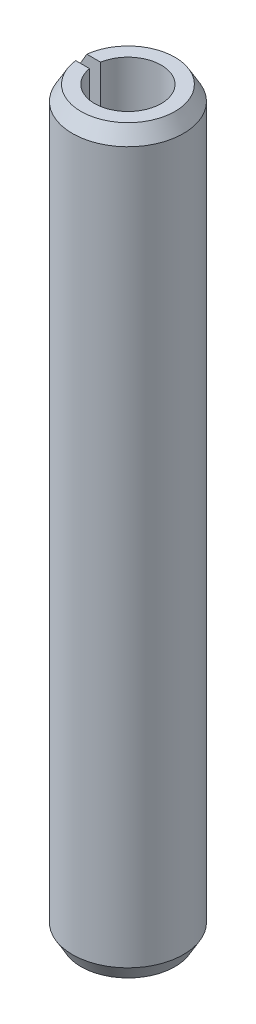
ISO-10303-21;
HEADER;
FILE_DESCRIPTION(('STEP AP214'),'2;1');
FILE_NAME('part.step','',(''),(''),'','','');
FILE_SCHEMA(('AUTOMOTIVE_DESIGN { 1 0 10303 214 1 1 1 1 }'));
ENDSEC;
DATA;
#1=APPLICATION_CONTEXT('core data for automotive mechanical design processes');
#2=APPLICATION_PROTOCOL_DEFINITION('international standard','automotive_design',2000,#1);
#3=PRODUCT_CONTEXT('',#1,'mechanical');
#4=PRODUCT('Part','Part','',(#3));
#5=PRODUCT_RELATED_PRODUCT_CATEGORY('part','',(#4));
#6=PRODUCT_DEFINITION_FORMATION('','',#4);
#7=PRODUCT_DEFINITION_CONTEXT('part definition',#1,'design');
#8=PRODUCT_DEFINITION('design','',#6,#7);
#9=PRODUCT_DEFINITION_SHAPE('','',#8);
#10=(LENGTH_UNIT() NAMED_UNIT(*) SI_UNIT(.MILLI.,.METRE.));
#11=(NAMED_UNIT(*) PLANE_ANGLE_UNIT() SI_UNIT($,.RADIAN.));
#12=(NAMED_UNIT(*) SI_UNIT($,.STERADIAN.) SOLID_ANGLE_UNIT());
#13=UNCERTAINTY_MEASURE_WITH_UNIT(LENGTH_MEASURE(1.E-05),#10,'distance_accuracy_value','');
#14=(GEOMETRIC_REPRESENTATION_CONTEXT(3) GLOBAL_UNCERTAINTY_ASSIGNED_CONTEXT((#13)) GLOBAL_UNIT_ASSIGNED_CONTEXT((#10,
#11,#12)) REPRESENTATION_CONTEXT('',''));
#15=CARTESIAN_POINT('',(0.,0.,0.));
#16=DIRECTION('',(0.,0.,1.));
#17=DIRECTION('',(1.,0.,0.));
#18=AXIS2_PLACEMENT_3D('',#15,#16,#17);
#19=CARTESIAN_POINT('',(0.,0.,0.));
#20=DIRECTION('',(0.,-1.,0.));
#21=DIRECTION('',(0.,0.,-0.999999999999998));
#22=AXIS2_PLACEMENT_3D('',#19,#20,#21);
#23=CYLINDRICAL_SURFACE('',#22,0.9);
#24=DIRECTION('',(0.,-1.,0.));
#25=VECTOR('',#24,1.);
#26=CARTESIAN_POINT('',(-0.887411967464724,0.,-0.150000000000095));
#27=LINE('',#26,#25);
#28=CARTESIAN_POINT('',(-0.887411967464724,0.,-0.150000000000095));
#29=VERTEX_POINT('',#28);
#30=CARTESIAN_POINT('',(-0.887411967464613,20.,-0.150000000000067));
#31=VERTEX_POINT('',#30);
#32=EDGE_CURVE('E88',#29,#31,#27,.F.);
#33=ORIENTED_EDGE('',*,*,#32,.F.);
#34=CARTESIAN_POINT('',(0.,0.,0.));
#35=DIRECTION('',(0.,-1.,0.));
#36=DIRECTION('',(0.,0.,-0.999999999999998));
#37=AXIS2_PLACEMENT_3D('',#34,#35,#36);
#38=CIRCLE('',#37,0.9);
#39=CARTESIAN_POINT('',(-0.887411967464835,0.,0.1499999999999));
#40=VERTEX_POINT('',#39);
#41=EDGE_CURVE('E100',#29,#40,#38,.T.);
#42=ORIENTED_EDGE('',*,*,#41,.T.);
#43=DIRECTION('',(0.,-1.,0.));
#44=VECTOR('',#43,1.);
#45=CARTESIAN_POINT('',(-0.887411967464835,0.,0.1499999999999));
#46=LINE('',#45,#44);
#47=CARTESIAN_POINT('',(-0.887411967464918,20.,0.149999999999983));
#48=VERTEX_POINT('',#47);
#49=EDGE_CURVE('E139',#48,#40,#46,.T.);
#50=ORIENTED_EDGE('',*,*,#49,.F.);
#51=CARTESIAN_POINT('',(0.,20.0000000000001,0.));
#52=DIRECTION('',(0.,-1.,0.));
#53=DIRECTION('',(0.,0.,-0.999999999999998));
#54=AXIS2_PLACEMENT_3D('',#51,#52,#53);
#55=CIRCLE('',#54,0.9);
#56=EDGE_CURVE('E102',#31,#48,#55,.T.);
#57=ORIENTED_EDGE('',*,*,#56,.F.);
#58=EDGE_LOOP('',(#33,#42,#50,#57));
#59=FACE_BOUND('',#58,.T.);
#60=ADVANCED_FACE('F31',(#59),#23,.F.);
#61=CARTESIAN_POINT('',(0.900000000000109,20.,-1.11022302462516E-13));
#62=DIRECTION('',(0.,1.,0.));
#63=DIRECTION('',(0.,0.,0.999999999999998));
#64=AXIS2_PLACEMENT_3D('',#61,#62,#63);
#65=PLANE('',#64);
#66=DIRECTION('',(-0.999999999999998,0.,0.));
#67=VECTOR('',#66,1.);
#68=CARTESIAN_POINT('',(0.,20.,-0.150000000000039));
#69=LINE('',#68,#67);
#70=CARTESIAN_POINT('',(-1.26016388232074,20.,-0.150000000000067));
#71=VERTEX_POINT('',#70);
#72=EDGE_CURVE('E157',#31,#71,#69,.T.);
#73=ORIENTED_EDGE('',*,*,#72,.F.);
#74=ORIENTED_EDGE('',*,*,#56,.T.);
#75=DIRECTION('',(0.999999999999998,0.,0.));
#76=VECTOR('',#75,1.);
#77=CARTESIAN_POINT('',(2.22044604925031E-13,19.9999999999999,0.149999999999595));
#78=LINE('',#77,#76);
#79=CARTESIAN_POINT('',(-1.26016388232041,20.,0.149999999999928));
#80=VERTEX_POINT('',#79);
#81=EDGE_CURVE('E94',#80,#48,#78,.T.);
#82=ORIENTED_EDGE('',*,*,#81,.F.);
#83=CARTESIAN_POINT('',(0.,20.0000000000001,0.));
#84=DIRECTION('',(0.,1.,0.));
#85=DIRECTION('',(0.,0.,0.999999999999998));
#86=AXIS2_PLACEMENT_3D('',#83,#84,#85);
#87=CIRCLE('',#86,1.26905989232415);
#88=EDGE_CURVE('E116',#80,#71,#87,.T.);
#89=ORIENTED_EDGE('',*,*,#88,.T.);
#90=EDGE_LOOP('',(#73,#74,#82,#89));
#91=FACE_BOUND('',#90,.T.);
#92=ADVANCED_FACE('F155',(#91),#65,.T.);
#93=CARTESIAN_POINT('',(0.,0.,0.));
#94=DIRECTION('',(0.,-1.,0.));
#95=DIRECTION('',(0.,0.,-0.999999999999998));
#96=AXIS2_PLACEMENT_3D('',#93,#94,#95);
#97=CYLINDRICAL_SURFACE('',#96,1.5);
#98=DIRECTION('',(0.,-1.,0.));
#99=VECTOR('',#98,1.);
#100=CARTESIAN_POINT('',(-1.49248115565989,0.,-0.150000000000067));
#101=LINE('',#100,#99);
#102=CARTESIAN_POINT('',(-1.49248115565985,19.6,-0.150000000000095));
#103=VERTEX_POINT('',#102);
#104=CARTESIAN_POINT('',(-1.49248115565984,0.400000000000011,-0.150000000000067));
#105=VERTEX_POINT('',#104);
#106=EDGE_CURVE('E57',#103,#105,#101,.T.);
#107=ORIENTED_EDGE('',*,*,#106,.F.);
#108=CARTESIAN_POINT('',(0.,19.6,0.));
#109=DIRECTION('',(0.,1.,0.));
#110=DIRECTION('',(0.,0.,0.999999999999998));
#111=AXIS2_PLACEMENT_3D('',#108,#109,#110);
#112=CIRCLE('',#111,1.5);
#113=CARTESIAN_POINT('',(-1.49248115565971,19.6,0.150000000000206));
#114=VERTEX_POINT('',#113);
#115=EDGE_CURVE('E113',#103,#114,#112,.F.);
#116=ORIENTED_EDGE('',*,*,#115,.T.);
#117=DIRECTION('',(0.,-1.,0.));
#118=VECTOR('',#117,1.);
#119=CARTESIAN_POINT('',(-1.49248115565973,0.,0.149999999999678));
#120=LINE('',#119,#118);
#121=CARTESIAN_POINT('',(-1.49248115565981,0.400000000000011,0.150000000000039));
#122=VERTEX_POINT('',#121);
#123=EDGE_CURVE('E140',#122,#114,#120,.F.);
#124=ORIENTED_EDGE('',*,*,#123,.F.);
#125=CARTESIAN_POINT('',(2.77555756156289E-13,0.3999999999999,-1.11022302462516E-13));
#126=DIRECTION('',(0.,-1.,0.));
#127=DIRECTION('',(0.,0.,-0.999999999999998));
#128=AXIS2_PLACEMENT_3D('',#125,#126,#127);
#129=CIRCLE('',#128,1.5);
#130=EDGE_CURVE('E107',#122,#105,#129,.F.);
#131=ORIENTED_EDGE('',*,*,#130,.T.);
#132=EDGE_LOOP('',(#107,#116,#124,#131));
#133=FACE_BOUND('',#132,.T.);
#134=ADVANCED_FACE('F166',(#133),#97,.T.);
#135=CARTESIAN_POINT('',(0.900000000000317,0.,0.));
#136=DIRECTION('',(0.,-1.,0.));
#137=DIRECTION('',(0.,0.,-0.999999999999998));
#138=AXIS2_PLACEMENT_3D('',#135,#136,#137);
#139=PLANE('',#138);
#140=DIRECTION('',(-0.999999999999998,0.,0.));
#141=VECTOR('',#140,1.);
#142=CARTESIAN_POINT('',(2.4980018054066E-13,0.,-0.1499999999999));
#143=LINE('',#142,#141);
#144=CARTESIAN_POINT('',(-1.26016388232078,0.,-0.150000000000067));
#145=VERTEX_POINT('',#144);
#146=EDGE_CURVE('E85',#29,#145,#143,.T.);
#147=ORIENTED_EDGE('',*,*,#146,.T.);
#148=CARTESIAN_POINT('',(0.,0.,0.));
#149=DIRECTION('',(0.,-1.,0.));
#150=DIRECTION('',(0.,0.,-0.999999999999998));
#151=AXIS2_PLACEMENT_3D('',#148,#149,#150);
#152=CIRCLE('',#151,1.26905989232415);
#153=CARTESIAN_POINT('',(-1.26016388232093,0.,0.149999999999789));
#154=VERTEX_POINT('',#153);
#155=EDGE_CURVE('E119',#145,#154,#152,.T.);
#156=ORIENTED_EDGE('',*,*,#155,.T.);
#157=DIRECTION('',(0.999999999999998,0.,0.));
#158=VECTOR('',#157,1.);
#159=CARTESIAN_POINT('',(0.,0.,0.149999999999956));
#160=LINE('',#159,#158);
#161=EDGE_CURVE('E50',#154,#40,#160,.T.);
#162=ORIENTED_EDGE('',*,*,#161,.T.);
#163=ORIENTED_EDGE('',*,*,#41,.F.);
#164=EDGE_LOOP('',(#147,#156,#162,#163));
#165=FACE_BOUND('',#164,.T.);
#166=ADVANCED_FACE('F105',(#165),#139,.T.);
#167=CARTESIAN_POINT('',(0.,19.6,0.));
#168=DIRECTION('',(0.,-1.,0.));
#169=DIRECTION('',(0.,0.,-0.999999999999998));
#170=AXIS2_PLACEMENT_3D('',#167,#168,#169);
#171=CONICAL_SURFACE('',#170,1.5,0.523598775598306);
#172=CARTESIAN_POINT('',(-0.435283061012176,21.4006340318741,-0.150000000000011));
#173=CARTESIAN_POINT('',(-0.461935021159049,21.3569640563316,-0.149999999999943));
#174=CARTESIAN_POINT('',(-0.488422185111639,21.3131943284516,-0.14999999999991));
#175=CARTESIAN_POINT('',(-0.541157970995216,21.2255120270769,-0.149999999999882));
#176=CARTESIAN_POINT('',(-0.567406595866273,21.1815994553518,-0.149999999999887));
#177=CARTESIAN_POINT('',(-0.645931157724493,21.0497326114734,-0.149999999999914));
#178=CARTESIAN_POINT('',(-0.697986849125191,20.9616474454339,-0.149999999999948));
#179=CARTESIAN_POINT('',(-0.852293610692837,20.6995840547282,-0.149999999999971));
#180=CARTESIAN_POINT('',(-0.954137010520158,20.5253663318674,-0.149999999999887));
#181=CARTESIAN_POINT('',(-1.15743874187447,20.1767021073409,-0.149999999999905));
#182=CARTESIAN_POINT('',(-1.25889706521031,20.0022556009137,-0.150000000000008));
#183=CARTESIAN_POINT('',(-1.5130147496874,19.5647816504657,-0.150000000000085));
#184=CARTESIAN_POINT('',(-1.66555369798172,19.3016842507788,-0.149999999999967));
#185=CARTESIAN_POINT('',(-1.97041809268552,18.7753802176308,-0.149999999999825));
#186=CARTESIAN_POINT('',(-2.1227435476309,18.5121735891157,-0.149999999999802));
#187=CARTESIAN_POINT('',(-2.27507692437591,18.2489718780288,-0.150000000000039));
#188=B_SPLINE_CURVE_WITH_KNOTS('',3,(#172,#173,#174,#175,#176,#177,#178,#179,#180,#181,#182,
#183,#184,#185,#186,#187),.UNSPECIFIED.,.F.,.F.,(4,2,2,2,2,2,2,4),(0.,0.153480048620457,
0.306958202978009,0.613908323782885,1.21931139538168,1.82472727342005,2.73708406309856,
3.64940327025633),.UNSPECIFIED.);
#189=EDGE_CURVE('E103',#71,#103,#188,.T.);
#190=ORIENTED_EDGE('',*,*,#189,.F.);
#191=ORIENTED_EDGE('',*,*,#88,.F.);
#192=CARTESIAN_POINT('',(-2.27507692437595,18.2489718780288,0.149999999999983));
#193=CARTESIAN_POINT('',(-2.19892364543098,18.3805853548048,0.149999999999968));
#194=CARTESIAN_POINT('',(-2.12275968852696,18.5121926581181,0.149999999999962));
#195=CARTESIAN_POINT('',(-1.97039748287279,18.7753869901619,0.149999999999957));
#196=CARTESIAN_POINT('',(-1.89419923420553,18.9069740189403,0.149999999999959));
#197=CARTESIAN_POINT('',(-1.74175594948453,19.1701191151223,0.149999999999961));
#198=CARTESIAN_POINT('',(-1.66551091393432,19.3016771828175,0.149999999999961));
#199=CARTESIAN_POINT('',(-1.51294962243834,19.5647524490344,0.149999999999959));
#200=CARTESIAN_POINT('',(-1.43663336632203,19.6962696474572,0.149999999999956));
#201=CARTESIAN_POINT('',(-1.28388647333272,19.9592409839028,0.149999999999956));
#202=CARTESIAN_POINT('',(-1.20745583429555,20.0906951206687,0.149999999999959));
#203=CARTESIAN_POINT('',(-1.05440420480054,20.3534916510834,0.149999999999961));
#204=CARTESIAN_POINT('',(-0.977783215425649,20.4848340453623,0.149999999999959));
#205=CARTESIAN_POINT('',(-0.862567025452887,20.6816831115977,0.14999999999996));
#206=CARTESIAN_POINT('',(-0.82411374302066,20.747272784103,0.149999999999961));
#207=CARTESIAN_POINT('',(-0.74705918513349,20.8783646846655,0.149999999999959));
#208=CARTESIAN_POINT('',(-0.708457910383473,20.9438669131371,0.149999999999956));
#209=CARTESIAN_POINT('',(-0.631033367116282,21.0747425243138,0.149999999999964));
#210=CARTESIAN_POINT('',(-0.592210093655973,21.140115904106,0.149999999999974));
#211=CARTESIAN_POINT('',(-0.514127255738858,21.2706028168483,0.149999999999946));
#212=CARTESIAN_POINT('',(-0.474867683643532,21.3357163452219,0.149999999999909));
#213=CARTESIAN_POINT('',(-0.435283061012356,21.4006340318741,0.149999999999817));
#214=B_SPLINE_CURVE_WITH_KNOTS('',3,(#192,#193,#194,#195,#196,#197,#198,#199,#200,#201,#202,
#203,#204,#205,#206,#207,#208,#209,#210,#211,#212,#213),.UNSPECIFIED.,.F.,.F.,(4,2,2,2,2,2,2,2,
2,2,4),(0.,0.456171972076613,0.912342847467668,1.36850889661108,1.82467604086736,
2.28085192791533,2.7370252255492,2.96511701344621,3.19320771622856,3.42130351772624,
3.6494033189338),.UNSPECIFIED.);
#215=EDGE_CURVE('E133',#114,#80,#214,.T.);
#216=ORIENTED_EDGE('',*,*,#215,.F.);
#217=ORIENTED_EDGE('',*,*,#115,.F.);
#218=EDGE_LOOP('',(#190,#191,#216,#217));
#219=FACE_BOUND('',#218,.T.);
#220=ADVANCED_FACE('F143',(#219),#171,.T.);
#221=CARTESIAN_POINT('',(0.,0.,0.));
#222=DIRECTION('',(0.,1.,0.));
#223=DIRECTION('',(0.,0.,0.999999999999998));
#224=AXIS2_PLACEMENT_3D('',#221,#222,#223);
#225=CONICAL_SURFACE('',#224,1.26905989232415,0.523598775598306);
#226=CARTESIAN_POINT('',(-2.27507692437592,1.75102812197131,-0.150000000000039));
#227=CARTESIAN_POINT('',(-2.19892364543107,1.61941464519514,-0.149999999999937));
#228=CARTESIAN_POINT('',(-2.12275968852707,1.48780734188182,-0.149999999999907));
#229=CARTESIAN_POINT('',(-1.97039748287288,1.22461300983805,-0.149999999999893));
#230=CARTESIAN_POINT('',(-1.89419923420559,1.09302598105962,-0.149999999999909));
#231=CARTESIAN_POINT('',(-1.74175594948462,0.829880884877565,-0.149999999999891));
#232=CARTESIAN_POINT('',(-1.66551091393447,0.698322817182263,-0.149999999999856));
#233=CARTESIAN_POINT('',(-1.51294962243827,0.435247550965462,-0.149999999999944));
#234=CARTESIAN_POINT('',(-1.43663336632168,0.303730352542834,-0.150000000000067));
#235=CARTESIAN_POINT('',(-1.28388647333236,0.0407590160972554,-0.150000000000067));
#236=CARTESIAN_POINT('',(-1.20745583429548,-0.0906951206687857,-0.149999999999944));
#237=CARTESIAN_POINT('',(-1.05440420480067,-0.353491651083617,-0.149999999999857));
#238=CARTESIAN_POINT('',(-0.977783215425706,-0.484834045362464,-0.149999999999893));
#239=CARTESIAN_POINT('',(-0.862567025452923,-0.681683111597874,-0.149999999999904));
#240=CARTESIAN_POINT('',(-0.824113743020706,-0.747272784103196,-0.1499999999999));
#241=CARTESIAN_POINT('',(-0.747059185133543,-0.878364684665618,-0.149999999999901));
#242=CARTESIAN_POINT('',(-0.708457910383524,-0.943866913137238,-0.149999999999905));
#243=CARTESIAN_POINT('',(-0.631033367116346,-1.074742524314,-0.149999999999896));
#244=CARTESIAN_POINT('',(-0.592210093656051,-1.1401159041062,-0.149999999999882));
#245=CARTESIAN_POINT('',(-0.514127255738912,-1.27060281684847,-0.149999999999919));
#246=CARTESIAN_POINT('',(-0.474867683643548,-1.33571634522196,-0.14999999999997));
#247=CARTESIAN_POINT('',(-0.435283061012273,-1.40063403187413,-0.150000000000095));
#248=B_SPLINE_CURVE_WITH_KNOTS('',3,(#226,#227,#228,#229,#230,#231,#232,#233,#234,#235,#236,
#237,#238,#239,#240,#241,#242,#243,#244,#245,#246,#247),.UNSPECIFIED.,.F.,.F.,(4,2,2,2,2,2,2,2,
2,2,4),(0.,0.456171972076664,0.912342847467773,1.36850889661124,1.82467604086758,
2.28085192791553,2.73702522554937,2.96511701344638,3.19320771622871,3.42130351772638,
3.64940331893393),.UNSPECIFIED.);
#249=EDGE_CURVE('E11',#105,#145,#248,.T.);
#250=ORIENTED_EDGE('',*,*,#249,.F.);
#251=ORIENTED_EDGE('',*,*,#130,.F.);
#252=CARTESIAN_POINT('',(-0.435283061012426,-1.40063403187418,0.149999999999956));
#253=CARTESIAN_POINT('',(-0.461935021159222,-1.35696405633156,0.149999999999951));
#254=CARTESIAN_POINT('',(-0.488422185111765,-1.31319432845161,0.149999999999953));
#255=CARTESIAN_POINT('',(-0.541157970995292,-1.22551202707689,0.149999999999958));
#256=CARTESIAN_POINT('',(-0.567406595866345,-1.1815994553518,0.14999999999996));
#257=CARTESIAN_POINT('',(-0.645931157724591,-1.04973261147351,0.149999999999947));
#258=CARTESIAN_POINT('',(-0.697986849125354,-0.961647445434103,0.149999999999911));
#259=CARTESIAN_POINT('',(-0.852293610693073,-0.699584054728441,0.14999999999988));
#260=CARTESIAN_POINT('',(-0.95413701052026,-0.525366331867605,0.149999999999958));
#261=CARTESIAN_POINT('',(-1.15743874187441,-0.176702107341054,0.149999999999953));
#262=CARTESIAN_POINT('',(-1.25889706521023,-0.002255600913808,0.14999999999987));
#263=CARTESIAN_POINT('',(-1.51301474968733,0.435218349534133,0.149999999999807));
#264=CARTESIAN_POINT('',(-1.66555369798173,0.69831574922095,0.149999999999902));
#265=CARTESIAN_POINT('',(-1.97041809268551,1.22461978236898,0.15000000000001));
#266=CARTESIAN_POINT('',(-2.12274354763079,1.48782641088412,0.150000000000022));
#267=CARTESIAN_POINT('',(-2.27507692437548,1.75102812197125,0.149999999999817));
#268=B_SPLINE_CURVE_WITH_KNOTS('',3,(#252,#253,#254,#255,#256,#257,#258,#259,#260,#261,#262,
#263,#264,#265,#266,#267),.UNSPECIFIED.,.F.,.F.,(4,2,2,2,2,2,2,4),(0.,0.153480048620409,
0.306958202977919,0.613908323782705,1.21931139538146,1.82472727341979,2.73708406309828,
3.64940327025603),.UNSPECIFIED.);
#269=EDGE_CURVE('E43',#154,#122,#268,.T.);
#270=ORIENTED_EDGE('',*,*,#269,.F.);
#271=ORIENTED_EDGE('',*,*,#155,.F.);
#272=EDGE_LOOP('',(#250,#251,#270,#271));
#273=FACE_BOUND('',#272,.T.);
#274=ADVANCED_FACE('F124',(#273),#225,.T.);
#275=CARTESIAN_POINT('',(0.,0.,0.149999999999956));
#276=DIRECTION('',(0.,0.,0.999999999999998));
#277=DIRECTION('',(0.999999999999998,0.,0.));
#278=AXIS2_PLACEMENT_3D('',#275,#276,#277);
#279=PLANE('',#278);
#280=ORIENTED_EDGE('',*,*,#49,.T.);
#281=ORIENTED_EDGE('',*,*,#161,.F.);
#282=ORIENTED_EDGE('',*,*,#269,.T.);
#283=ORIENTED_EDGE('',*,*,#123,.T.);
#284=ORIENTED_EDGE('',*,*,#215,.T.);
#285=ORIENTED_EDGE('',*,*,#81,.T.);
#286=EDGE_LOOP('',(#280,#281,#282,#283,#284,#285));
#287=FACE_BOUND('',#286,.T.);
#288=ADVANCED_FACE('F127',(#287),#279,.F.);
#289=CARTESIAN_POINT('',(2.4980018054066E-13,0.,-0.1499999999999));
#290=DIRECTION('',(0.,0.,-0.999999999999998));
#291=DIRECTION('',(-0.999999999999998,0.,0.));
#292=AXIS2_PLACEMENT_3D('',#289,#290,#291);
#293=PLANE('',#292);
#294=ORIENTED_EDGE('',*,*,#32,.T.);
#295=ORIENTED_EDGE('',*,*,#72,.T.);
#296=ORIENTED_EDGE('',*,*,#189,.T.);
#297=ORIENTED_EDGE('',*,*,#106,.T.);
#298=ORIENTED_EDGE('',*,*,#249,.T.);
#299=ORIENTED_EDGE('',*,*,#146,.F.);
#300=EDGE_LOOP('',(#294,#295,#296,#297,#298,#299));
#301=FACE_BOUND('',#300,.T.);
#302=ADVANCED_FACE('F87',(#301),#293,.F.);
#303=CLOSED_SHELL('',(#60,#92,#134,#166,#220,#274,#288,#302));
#304=MANIFOLD_SOLID_BREP('B2',#303);
#305=ADVANCED_BREP_SHAPE_REPRESENTATION('',(#18,#304),#14);
#306=SHAPE_DEFINITION_REPRESENTATION(#9,#305);
ENDSEC;
END-ISO-10303-21;
